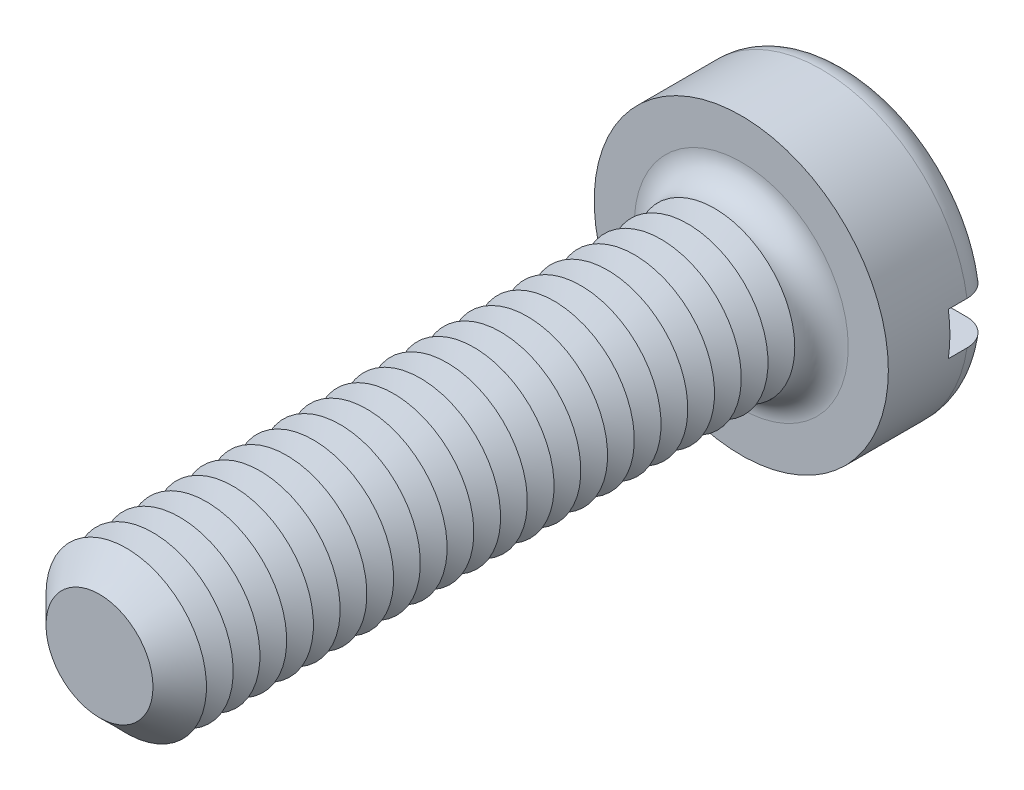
from build123d import *

# Parameters (mm, degrees)
SKETCH3_R           = 2.75
BOSS_EXTRUDE2_DEPTH = 2
SKETCH4_R           = 1.5
BOSS_EXTRUDE3_DEPTH = 12
FILLET1_R           = 0.5
CHAMFER1_SIZE       = 0.5
LPATTERN1_COUNT     = 22
LPATTERN1_PITCH     = 0.5
SKETCH8_W           = 5.5
SKETCH8_H           = 0.8
CUT_EXTRUDE1_DEPTH  = 0.85


with BuildPart() as part:
    # Sketch3 → Boss-Extrude2 (new body)
    with BuildSketch(Plane.XY):
        Circle(SKETCH3_R)
    extrude(amount=-BOSS_EXTRUDE2_DEPTH)

    # Sketch4 → Boss-Extrude3 (add)
    with BuildSketch(Plane.XY):
        Circle(SKETCH4_R)
    extrude(amount=BOSS_EXTRUDE3_DEPTH)

    # Fillet1
    fillet1_edges = [part.edges().sort_by_distance(p)[0] for p in [
        (-2.75, 0, -2),
        (-1.5, 0, 0),
    ]]
    fillet(fillet1_edges, radius=FILLET1_R)

    # Chamfer1
    chamfer1_edges = [part.edges().sort_by_distance(p)[0] for p in [
        (-1.5, 0, 12),
    ]]
    chamfer(chamfer1_edges, length=CHAMFER1_SIZE)

    # Sketch6 → Cut-Revolve1 (revolve, cut)
    with BuildSketch(Plane(origin=(0, 0, 0), x_dir=(0, 0, -1), z_dir=(1, 0, 0)), mode=Mode.PRIVATE) as cut_revolve1_sk:
        Polygon((-0.5, 1.5), (-0.75, 1.066987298), (-1, 1.5), align=None)
    cut_revolve1 = revolve(cut_revolve1_sk.sketch.rotate(Axis((0, 0, -1.694361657), (0, 0, 1)), 90), axis=Axis((0, 0, -1.694361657), (0, 0, 1)), mode=Mode.SUBTRACT)

    # LPattern1: Cut-Revolve1 ×22
    with Locations(*[(0, 0, i * LPATTERN1_PITCH) for i in range(1, LPATTERN1_COUNT)]):
        add(cut_revolve1, mode=Mode.SUBTRACT)

    # Sketch8 → Cut-Extrude1 (cut)
    with BuildSketch(Plane(origin=(0, 0, -2), x_dir=(-1, 0, 0), z_dir=(0, 0, -1))):
        Rectangle(SKETCH8_W, SKETCH8_H)
    extrude(amount=-CUT_EXTRUDE1_DEPTH, mode=Mode.SUBTRACT)


solid = part.part
